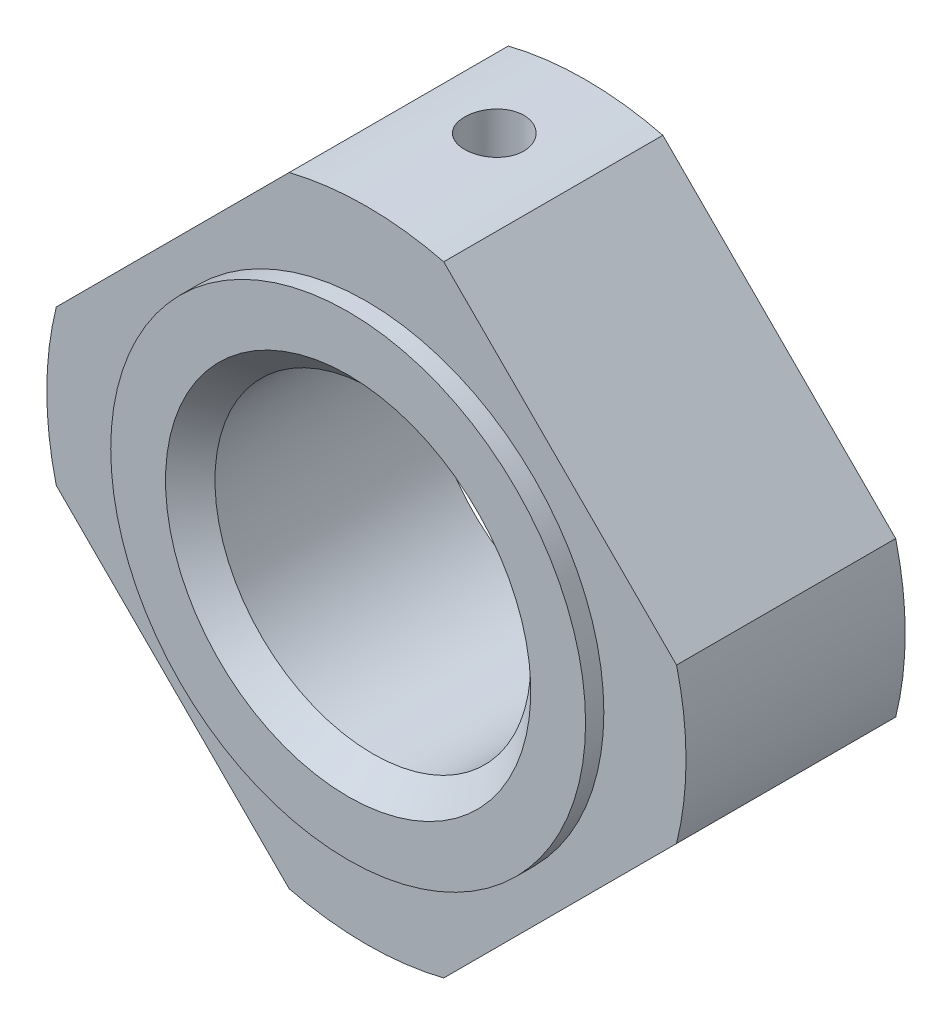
ISO-10303-21;
HEADER;
FILE_DESCRIPTION(('STEP AP214'),'2;1');
FILE_NAME('part.step','',(''),(''),'','','');
FILE_SCHEMA(('AUTOMOTIVE_DESIGN { 1 0 10303 214 1 1 1 1 }'));
ENDSEC;
DATA;
#1=APPLICATION_CONTEXT('core data for automotive mechanical design processes');
#2=APPLICATION_PROTOCOL_DEFINITION('international standard','automotive_design',2000,#1);
#3=PRODUCT_CONTEXT('',#1,'mechanical');
#4=PRODUCT('Part','Part','',(#3));
#5=PRODUCT_RELATED_PRODUCT_CATEGORY('part','',(#4));
#6=PRODUCT_DEFINITION_FORMATION('','',#4);
#7=PRODUCT_DEFINITION_CONTEXT('part definition',#1,'design');
#8=PRODUCT_DEFINITION('design','',#6,#7);
#9=PRODUCT_DEFINITION_SHAPE('','',#8);
#10=(LENGTH_UNIT() NAMED_UNIT(*) SI_UNIT(.MILLI.,.METRE.));
#11=(NAMED_UNIT(*) PLANE_ANGLE_UNIT() SI_UNIT($,.RADIAN.));
#12=(NAMED_UNIT(*) SI_UNIT($,.STERADIAN.) SOLID_ANGLE_UNIT());
#13=UNCERTAINTY_MEASURE_WITH_UNIT(LENGTH_MEASURE(1.E-05),#10,'distance_accuracy_value','');
#14=(GEOMETRIC_REPRESENTATION_CONTEXT(3) GLOBAL_UNCERTAINTY_ASSIGNED_CONTEXT((#13)) GLOBAL_UNIT_ASSIGNED_CONTEXT((#10,
#11,#12)) REPRESENTATION_CONTEXT('',''));
#15=CARTESIAN_POINT('',(0.,0.,0.));
#16=DIRECTION('',(0.,0.,1.));
#17=DIRECTION('',(1.,0.,0.));
#18=AXIS2_PLACEMENT_3D('',#15,#16,#17);
#19=CARTESIAN_POINT('',(-1.00613961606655E-13,0.,12.));
#20=DIRECTION('',(0.,0.,1.));
#21=DIRECTION('',(1.,0.,0.));
#22=AXIS2_PLACEMENT_3D('',#19,#20,#21);
#23=PLANE('',#22);
#24=CARTESIAN_POINT('',(0.,0.,12.));
#25=DIRECTION('',(0.,0.,1.));
#26=DIRECTION('',(1.,0.,0.));
#27=AXIS2_PLACEMENT_3D('',#24,#25,#26);
#28=CIRCLE('',#27,13.);
#29=CARTESIAN_POINT('',(13.,0.,12.));
#30=VERTEX_POINT('',#29);
#31=EDGE_CURVE('E19',#30,#30,#28,.T.);
#32=ORIENTED_EDGE('',*,*,#31,.F.);
#33=EDGE_LOOP('',(#32));
#34=FACE_BOUND('',#33,.T.);
#35=DIRECTION('',(0.707106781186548,-0.707106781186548,0.));
#36=VECTOR('',#35,1.);
#37=CARTESIAN_POINT('',(16.9803761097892,4.23282732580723,12.));
#38=LINE('',#37,#36);
#39=CARTESIAN_POINT('',(16.9803761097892,4.23282732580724,12.));
#40=VERTEX_POINT('',#39);
#41=CARTESIAN_POINT('',(4.23282732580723,16.9803761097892,12.));
#42=VERTEX_POINT('',#41);
#43=EDGE_CURVE('E105',#40,#42,#38,.F.);
#44=ORIENTED_EDGE('',*,*,#43,.T.);
#45=CARTESIAN_POINT('',(0.,0.,12.));
#46=DIRECTION('',(0.,0.,1.));
#47=DIRECTION('',(1.,0.,0.));
#48=AXIS2_PLACEMENT_3D('',#45,#46,#47);
#49=CIRCLE('',#48,17.5);
#50=CARTESIAN_POINT('',(-4.23282732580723,16.9803761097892,12.));
#51=VERTEX_POINT('',#50);
#52=EDGE_CURVE('E213',#51,#42,#49,.F.);
#53=ORIENTED_EDGE('',*,*,#52,.F.);
#54=DIRECTION('',(0.707106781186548,0.707106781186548,0.));
#55=VECTOR('',#54,1.);
#56=CARTESIAN_POINT('',(-4.23282732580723,16.9803761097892,12.));
#57=LINE('',#56,#55);
#58=CARTESIAN_POINT('',(-16.9803761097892,4.23282732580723,12.));
#59=VERTEX_POINT('',#58);
#60=EDGE_CURVE('E85',#51,#59,#57,.F.);
#61=ORIENTED_EDGE('',*,*,#60,.T.);
#62=CARTESIAN_POINT('',(-1.00613961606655E-13,0.,12.));
#63=DIRECTION('',(0.,0.,1.));
#64=DIRECTION('',(1.,0.,0.));
#65=AXIS2_PLACEMENT_3D('',#62,#63,#64);
#66=CIRCLE('',#65,17.5);
#67=CARTESIAN_POINT('',(-16.9803761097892,-4.23282732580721,12.));
#68=VERTEX_POINT('',#67);
#69=EDGE_CURVE('E79',#68,#59,#66,.F.);
#70=ORIENTED_EDGE('',*,*,#69,.F.);
#71=DIRECTION('',(-0.707106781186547,0.707106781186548,0.));
#72=VECTOR('',#71,1.);
#73=CARTESIAN_POINT('',(-16.9803761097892,-4.23282732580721,12.));
#74=LINE('',#73,#72);
#75=CARTESIAN_POINT('',(-4.23282732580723,-16.9803761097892,12.));
#76=VERTEX_POINT('',#75);
#77=EDGE_CURVE('E82',#68,#76,#74,.F.);
#78=ORIENTED_EDGE('',*,*,#77,.T.);
#79=CARTESIAN_POINT('',(0.,-1.17961196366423E-13,12.));
#80=DIRECTION('',(0.,0.,1.));
#81=DIRECTION('',(1.,0.,0.));
#82=AXIS2_PLACEMENT_3D('',#79,#80,#81);
#83=CIRCLE('',#82,17.5);
#84=CARTESIAN_POINT('',(4.23282732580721,-16.9803761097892,12.));
#85=VERTEX_POINT('',#84);
#86=EDGE_CURVE('E96',#85,#76,#83,.F.);
#87=ORIENTED_EDGE('',*,*,#86,.F.);
#88=DIRECTION('',(-0.707106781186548,-0.707106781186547,0.));
#89=VECTOR('',#88,1.);
#90=CARTESIAN_POINT('',(4.23282732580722,-16.9803761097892,12.));
#91=LINE('',#90,#89);
#92=CARTESIAN_POINT('',(16.9803761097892,-4.23282732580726,12.));
#93=VERTEX_POINT('',#92);
#94=EDGE_CURVE('E110',#85,#93,#91,.F.);
#95=ORIENTED_EDGE('',*,*,#94,.T.);
#96=CARTESIAN_POINT('',(0.,0.,12.));
#97=DIRECTION('',(0.,0.,1.));
#98=DIRECTION('',(1.,0.,0.));
#99=AXIS2_PLACEMENT_3D('',#96,#97,#98);
#100=CIRCLE('',#99,17.5);
#101=EDGE_CURVE('E112',#40,#93,#100,.F.);
#102=ORIENTED_EDGE('',*,*,#101,.F.);
#103=EDGE_LOOP('',(#44,#53,#61,#70,#78,#87,#95,#102));
#104=FACE_BOUND('',#103,.T.);
#105=ADVANCED_FACE('F16',(#34,#104),#23,.T.);
#106=CARTESIAN_POINT('',(0.,0.,13.));
#107=DIRECTION('',(0.,0.,1.));
#108=DIRECTION('',(1.,0.,0.));
#109=AXIS2_PLACEMENT_3D('',#106,#107,#108);
#110=CYLINDRICAL_SURFACE('',#109,13.);
#111=CARTESIAN_POINT('',(0.,0.,13.));
#112=DIRECTION('',(0.,0.,1.));
#113=DIRECTION('',(1.,0.,0.));
#114=AXIS2_PLACEMENT_3D('',#111,#112,#113);
#115=CIRCLE('',#114,13.);
#116=CARTESIAN_POINT('',(13.,0.,13.));
#117=VERTEX_POINT('',#116);
#118=EDGE_CURVE('E205',#117,#117,#115,.T.);
#119=ORIENTED_EDGE('',*,*,#118,.F.);
#120=EDGE_LOOP('',(#119));
#121=FACE_BOUND('',#120,.T.);
#122=ORIENTED_EDGE('',*,*,#31,.T.);
#123=EDGE_LOOP('',(#122));
#124=FACE_BOUND('',#123,.T.);
#125=ADVANCED_FACE('F194',(#121,#124),#110,.T.);
#126=CARTESIAN_POINT('',(-1.00613961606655E-13,0.,12.));
#127=DIRECTION('',(0.,0.,1.));
#128=DIRECTION('',(1.,0.,0.));
#129=AXIS2_PLACEMENT_3D('',#126,#127,#128);
#130=CYLINDRICAL_SURFACE('',#129,17.5);
#131=ORIENTED_EDGE('',*,*,#69,.T.);
#132=DIRECTION('',(0.,0.,1.));
#133=VECTOR('',#132,1.);
#134=CARTESIAN_POINT('',(-16.9803761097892,4.23282732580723,12.));
#135=LINE('',#134,#133);
#136=CARTESIAN_POINT('',(-16.9803761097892,4.23282732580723,0.));
#137=VERTEX_POINT('',#136);
#138=EDGE_CURVE('E109',#59,#137,#135,.F.);
#139=ORIENTED_EDGE('',*,*,#138,.T.);
#140=CARTESIAN_POINT('',(-1.00613961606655E-13,0.,0.));
#141=DIRECTION('',(0.,0.,1.));
#142=DIRECTION('',(1.,0.,0.));
#143=AXIS2_PLACEMENT_3D('',#140,#141,#142);
#144=CIRCLE('',#143,17.5);
#145=CARTESIAN_POINT('',(-16.9803761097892,-4.23282732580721,0.));
#146=VERTEX_POINT('',#145);
#147=EDGE_CURVE('E100',#137,#146,#144,.T.);
#148=ORIENTED_EDGE('',*,*,#147,.T.);
#149=DIRECTION('',(0.,0.,1.));
#150=VECTOR('',#149,1.);
#151=CARTESIAN_POINT('',(-16.9803761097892,-4.23282732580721,12.));
#152=LINE('',#151,#150);
#153=EDGE_CURVE('E90',#146,#68,#152,.T.);
#154=ORIENTED_EDGE('',*,*,#153,.T.);
#155=EDGE_LOOP('',(#131,#139,#148,#154));
#156=FACE_BOUND('',#155,.T.);
#157=ADVANCED_FACE('F99',(#156),#130,.T.);
#158=CARTESIAN_POINT('',(-16.9803761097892,-4.23282732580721,12.));
#159=DIRECTION('',(0.707106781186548,0.707106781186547,0.));
#160=DIRECTION('',(-0.707106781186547,0.707106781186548,0.));
#161=AXIS2_PLACEMENT_3D('',#158,#159,#160);
#162=PLANE('',#161);
#163=DIRECTION('',(0.,0.,1.));
#164=VECTOR('',#163,1.);
#165=CARTESIAN_POINT('',(-4.23282732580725,-16.9803761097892,12.));
#166=LINE('',#165,#164);
#167=CARTESIAN_POINT('',(-4.23282732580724,-16.9803761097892,0.));
#168=VERTEX_POINT('',#167);
#169=EDGE_CURVE('E95',#76,#168,#166,.F.);
#170=ORIENTED_EDGE('',*,*,#169,.F.);
#171=ORIENTED_EDGE('',*,*,#77,.F.);
#172=ORIENTED_EDGE('',*,*,#153,.F.);
#173=DIRECTION('',(0.707106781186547,-0.707106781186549,0.));
#174=VECTOR('',#173,1.);
#175=CARTESIAN_POINT('',(-16.9803761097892,-4.2328273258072,0.));
#176=LINE('',#175,#174);
#177=EDGE_CURVE('E211',#146,#168,#176,.T.);
#178=ORIENTED_EDGE('',*,*,#177,.T.);
#179=EDGE_LOOP('',(#170,#171,#172,#178));
#180=FACE_BOUND('',#179,.T.);
#181=ADVANCED_FACE('F92',(#180),#162,.F.);
#182=CARTESIAN_POINT('',(0.,-1.17961196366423E-13,12.));
#183=DIRECTION('',(0.,0.,1.));
#184=DIRECTION('',(1.,0.,0.));
#185=AXIS2_PLACEMENT_3D('',#182,#183,#184);
#186=CYLINDRICAL_SURFACE('',#185,17.5);
#187=ORIENTED_EDGE('',*,*,#86,.T.);
#188=ORIENTED_EDGE('',*,*,#169,.T.);
#189=CARTESIAN_POINT('',(0.,-1.17961196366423E-13,0.));
#190=DIRECTION('',(0.,0.,1.));
#191=DIRECTION('',(1.,0.,0.));
#192=AXIS2_PLACEMENT_3D('',#189,#190,#191);
#193=CIRCLE('',#192,17.5);
#194=CARTESIAN_POINT('',(4.2328273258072,-16.9803761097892,0.));
#195=VERTEX_POINT('',#194);
#196=EDGE_CURVE('E230',#168,#195,#193,.T.);
#197=ORIENTED_EDGE('',*,*,#196,.T.);
#198=DIRECTION('',(0.,0.,1.));
#199=VECTOR('',#198,1.);
#200=CARTESIAN_POINT('',(4.23282732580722,-16.9803761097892,12.));
#201=LINE('',#200,#199);
#202=EDGE_CURVE('E113',#195,#85,#201,.T.);
#203=ORIENTED_EDGE('',*,*,#202,.T.);
#204=EDGE_LOOP('',(#187,#188,#197,#203));
#205=FACE_BOUND('',#204,.T.);
#206=ADVANCED_FACE('F186',(#205),#186,.T.);
#207=CARTESIAN_POINT('',(4.23282732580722,-16.9803761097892,12.));
#208=DIRECTION('',(-0.707106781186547,0.707106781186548,0.));
#209=DIRECTION('',(-0.707106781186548,-0.707106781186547,0.));
#210=AXIS2_PLACEMENT_3D('',#207,#208,#209);
#211=PLANE('',#210);
#212=DIRECTION('',(0.,0.,1.));
#213=VECTOR('',#212,1.);
#214=CARTESIAN_POINT('',(16.9803761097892,-4.23282732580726,12.));
#215=LINE('',#214,#213);
#216=CARTESIAN_POINT('',(16.9803761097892,-4.23282732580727,0.));
#217=VERTEX_POINT('',#216);
#218=EDGE_CURVE('E219',#93,#217,#215,.F.);
#219=ORIENTED_EDGE('',*,*,#218,.F.);
#220=ORIENTED_EDGE('',*,*,#94,.F.);
#221=ORIENTED_EDGE('',*,*,#202,.F.);
#222=DIRECTION('',(0.707106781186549,0.707106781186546,0.));
#223=VECTOR('',#222,1.);
#224=CARTESIAN_POINT('',(4.23282732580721,-16.9803761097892,0.));
#225=LINE('',#224,#223);
#226=EDGE_CURVE('E231',#195,#217,#225,.T.);
#227=ORIENTED_EDGE('',*,*,#226,.T.);
#228=EDGE_LOOP('',(#219,#220,#221,#227));
#229=FACE_BOUND('',#228,.T.);
#230=ADVANCED_FACE('F182',(#229),#211,.F.);
#231=CARTESIAN_POINT('',(0.,0.,12.));
#232=DIRECTION('',(0.,0.,1.));
#233=DIRECTION('',(1.,0.,0.));
#234=AXIS2_PLACEMENT_3D('',#231,#232,#233);
#235=CYLINDRICAL_SURFACE('',#234,17.5);
#236=ORIENTED_EDGE('',*,*,#101,.T.);
#237=ORIENTED_EDGE('',*,*,#218,.T.);
#238=CARTESIAN_POINT('',(0.,0.,0.));
#239=DIRECTION('',(0.,0.,1.));
#240=DIRECTION('',(1.,0.,0.));
#241=AXIS2_PLACEMENT_3D('',#238,#239,#240);
#242=CIRCLE('',#241,17.5);
#243=CARTESIAN_POINT('',(16.9803761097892,4.23282732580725,0.));
#244=VERTEX_POINT('',#243);
#245=EDGE_CURVE('E234',#217,#244,#242,.T.);
#246=ORIENTED_EDGE('',*,*,#245,.T.);
#247=DIRECTION('',(0.,0.,1.));
#248=VECTOR('',#247,1.);
#249=CARTESIAN_POINT('',(16.9803761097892,4.23282732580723,12.));
#250=LINE('',#249,#248);
#251=EDGE_CURVE('E107',#244,#40,#250,.T.);
#252=ORIENTED_EDGE('',*,*,#251,.T.);
#253=EDGE_LOOP('',(#236,#237,#246,#252));
#254=FACE_BOUND('',#253,.T.);
#255=ADVANCED_FACE('F178',(#254),#235,.T.);
#256=CARTESIAN_POINT('',(16.9803761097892,4.23282732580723,12.));
#257=DIRECTION('',(-0.707106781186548,-0.707106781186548,0.));
#258=DIRECTION('',(0.707106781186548,-0.707106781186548,0.));
#259=AXIS2_PLACEMENT_3D('',#256,#257,#258);
#260=PLANE('',#259);
#261=DIRECTION('',(0.,0.,1.));
#262=VECTOR('',#261,1.);
#263=CARTESIAN_POINT('',(4.23282732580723,16.9803761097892,12.));
#264=LINE('',#263,#262);
#265=CARTESIAN_POINT('',(4.23282732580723,16.9803761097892,0.));
#266=VERTEX_POINT('',#265);
#267=EDGE_CURVE('E209',#42,#266,#264,.F.);
#268=ORIENTED_EDGE('',*,*,#267,.F.);
#269=ORIENTED_EDGE('',*,*,#43,.F.);
#270=ORIENTED_EDGE('',*,*,#251,.F.);
#271=DIRECTION('',(-0.707106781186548,0.707106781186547,0.));
#272=VECTOR('',#271,1.);
#273=CARTESIAN_POINT('',(16.9803761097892,4.23282732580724,0.));
#274=LINE('',#273,#272);
#275=EDGE_CURVE('E235',#244,#266,#274,.T.);
#276=ORIENTED_EDGE('',*,*,#275,.T.);
#277=EDGE_LOOP('',(#268,#269,#270,#276));
#278=FACE_BOUND('',#277,.T.);
#279=ADVANCED_FACE('F175',(#278),#260,.F.);
#280=CARTESIAN_POINT('',(-4.23282732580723,16.9803761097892,12.));
#281=DIRECTION('',(0.707106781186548,-0.707106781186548,0.));
#282=DIRECTION('',(0.707106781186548,0.707106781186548,0.));
#283=AXIS2_PLACEMENT_3D('',#280,#281,#282);
#284=PLANE('',#283);
#285=ORIENTED_EDGE('',*,*,#138,.F.);
#286=ORIENTED_EDGE('',*,*,#60,.F.);
#287=DIRECTION('',(0.,0.,1.));
#288=VECTOR('',#287,1.);
#289=CARTESIAN_POINT('',(-4.23282732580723,16.9803761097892,12.));
#290=LINE('',#289,#288);
#291=CARTESIAN_POINT('',(-4.23282732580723,16.9803761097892,0.));
#292=VERTEX_POINT('',#291);
#293=EDGE_CURVE('E34',#292,#51,#290,.T.);
#294=ORIENTED_EDGE('',*,*,#293,.F.);
#295=DIRECTION('',(-0.707106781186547,-0.707106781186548,0.));
#296=VECTOR('',#295,1.);
#297=CARTESIAN_POINT('',(-4.23282732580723,16.9803761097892,0.));
#298=LINE('',#297,#296);
#299=EDGE_CURVE('E156',#292,#137,#298,.T.);
#300=ORIENTED_EDGE('',*,*,#299,.T.);
#301=EDGE_LOOP('',(#285,#286,#294,#300));
#302=FACE_BOUND('',#301,.T.);
#303=ADVANCED_FACE('F171',(#302),#284,.F.);
#304=CARTESIAN_POINT('',(0.,0.,12.));
#305=DIRECTION('',(0.,0.,1.));
#306=DIRECTION('',(1.,0.,0.));
#307=AXIS2_PLACEMENT_3D('',#304,#305,#306);
#308=CYLINDRICAL_SURFACE('',#307,17.5);
#309=CARTESIAN_POINT('',(0.187161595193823,17.4989991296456,3.38984114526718));
#310=CARTESIAN_POINT('',(0.277498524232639,17.4980320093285,3.40034571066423));
#311=CARTESIAN_POINT('',(0.367003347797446,17.4963687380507,3.41847674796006));
#312=CARTESIAN_POINT('',(0.541747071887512,17.4918317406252,3.46949229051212));
#313=CARTESIAN_POINT('',(0.626981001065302,17.4889566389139,3.50239356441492));
#314=CARTESIAN_POINT('',(0.790655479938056,17.4823216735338,3.58198114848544));
#315=CARTESIAN_POINT('',(0.869100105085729,17.4785623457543,3.62865911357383));
#316=CARTESIAN_POINT('',(1.01702721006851,17.4705796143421,3.73447006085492));
#317=CARTESIAN_POINT('',(1.08651159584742,17.4663563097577,3.79360038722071));
#318=CARTESIAN_POINT('',(1.21477385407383,17.4579058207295,3.92283894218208));
#319=CARTESIAN_POINT('',(1.27352198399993,17.4536786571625,3.99297669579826));
#320=CARTESIAN_POINT('',(1.37841829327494,17.445708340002,4.14214347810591));
#321=CARTESIAN_POINT('',(1.424566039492,17.4419652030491,4.22117281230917));
#322=CARTESIAN_POINT('',(1.5029454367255,17.4353867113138,4.38590200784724));
#323=CARTESIAN_POINT('',(1.5351756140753,17.4325514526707,4.47160257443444));
#324=CARTESIAN_POINT('',(1.58477781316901,17.4281124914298,4.64723080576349));
#325=CARTESIAN_POINT('',(1.60215023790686,17.426508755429,4.73715835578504));
#326=CARTESIAN_POINT('',(1.62149297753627,17.4247196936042,4.91832962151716));
#327=CARTESIAN_POINT('',(1.62352037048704,17.4245291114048,5.00956719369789));
#328=CARTESIAN_POINT('',(1.61226443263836,17.4255741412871,5.19108351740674));
#329=CARTESIAN_POINT('',(1.59898130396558,17.4268097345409,5.28136228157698));
#330=CARTESIAN_POINT('',(1.55752868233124,17.4305631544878,5.45823810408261));
#331=CARTESIAN_POINT('',(1.52938527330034,17.4330787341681,5.54484132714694));
#332=CARTESIAN_POINT('',(1.45903717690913,17.4391069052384,5.71209751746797));
#333=CARTESIAN_POINT('',(1.41683219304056,17.4426195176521,5.79275035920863));
#334=CARTESIAN_POINT('',(1.31941333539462,17.4502588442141,5.94607812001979));
#335=CARTESIAN_POINT('',(1.26416134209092,17.4543873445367,6.01872872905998));
#336=CARTESIAN_POINT('',(1.14227261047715,17.4627871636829,6.15374443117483));
#337=CARTESIAN_POINT('',(1.07563564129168,17.4670584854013,6.21610931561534));
#338=CARTESIAN_POINT('',(0.932623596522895,17.4752782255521,6.32897593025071));
#339=CARTESIAN_POINT('',(0.856219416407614,17.4792256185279,6.37944086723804));
#340=CARTESIAN_POINT('',(0.695987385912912,17.4863382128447,6.46682300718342));
#341=CARTESIAN_POINT('',(0.612159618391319,17.4895034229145,6.50374036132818));
#342=CARTESIAN_POINT('',(0.439595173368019,17.4946903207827,6.56291512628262));
#343=CARTESIAN_POINT('',(0.350866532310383,17.4967138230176,6.58519580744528));
#344=CARTESIAN_POINT('',(0.170908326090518,17.4993966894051,6.61454090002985));
#345=CARTESIAN_POINT('',(0.0796788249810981,17.5000560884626,6.62160570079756));
#346=CARTESIAN_POINT('',(-0.102328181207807,17.4999365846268,6.62031519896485));
#347=CARTESIAN_POINT('',(-0.193106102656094,17.4991630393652,6.61201733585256));
#348=CARTESIAN_POINT('',(-0.371972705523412,17.4962750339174,6.58035637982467));
#349=CARTESIAN_POINT('',(-0.460061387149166,17.4941605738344,6.55699328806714));
#350=CARTESIAN_POINT('',(-0.63105359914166,17.4888276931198,6.49587947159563));
#351=CARTESIAN_POINT('',(-0.713957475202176,17.4856093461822,6.45812970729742));
#352=CARTESIAN_POINT('',(-0.872263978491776,17.4784279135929,6.36931887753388));
#353=CARTESIAN_POINT('',(-0.947666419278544,17.4744648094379,6.31825748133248));
#354=CARTESIAN_POINT('',(-1.08912857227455,17.4662201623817,6.20404905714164));
#355=CARTESIAN_POINT('',(-1.15515268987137,17.4619374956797,6.14085801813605));
#356=CARTESIAN_POINT('',(-1.27567162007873,17.4535475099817,6.00428933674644));
#357=CARTESIAN_POINT('',(-1.33016629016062,17.4494401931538,5.93091156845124));
#358=CARTESIAN_POINT('',(-1.42616860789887,17.4418569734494,5.77589303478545));
#359=CARTESIAN_POINT('',(-1.46765350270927,17.4383821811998,5.69423811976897));
#360=CARTESIAN_POINT('',(-1.53631360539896,17.4324678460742,5.52508366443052));
#361=CARTESIAN_POINT('',(-1.56348912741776,17.4300282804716,5.43758425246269));
#362=CARTESIAN_POINT('',(-1.60268191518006,17.4264684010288,5.25949895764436));
#363=CARTESIAN_POINT('',(-1.61474372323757,17.4253442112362,5.1689229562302));
#364=CARTESIAN_POINT('',(-1.62350334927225,17.4245303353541,4.98702542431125));
#365=CARTESIAN_POINT('',(-1.62020145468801,17.4248406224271,4.89570390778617));
#366=CARTESIAN_POINT('',(-1.59836484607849,17.4268570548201,4.71520093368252));
#367=CARTESIAN_POINT('',(-1.57987658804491,17.4285589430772,4.62601380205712));
#368=CARTESIAN_POINT('',(-1.52826280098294,17.4331603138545,4.45201356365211));
#369=CARTESIAN_POINT('',(-1.49513708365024,17.4360598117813,4.36720051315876));
#370=CARTESIAN_POINT('',(-1.41513058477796,17.4427352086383,4.20419663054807));
#371=CARTESIAN_POINT('',(-1.36822726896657,17.4465125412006,4.12601691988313));
#372=CARTESIAN_POINT('',(-1.26201565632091,17.4545164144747,3.97862397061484));
#373=CARTESIAN_POINT('',(-1.20270748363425,17.4587429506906,3.9094106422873));
#374=CARTESIAN_POINT('',(-1.07310995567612,17.4671880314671,3.78164607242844));
#375=CARTESIAN_POINT('',(-1.00278118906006,17.4714064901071,3.72313479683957));
#376=CARTESIAN_POINT('',(-0.853257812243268,17.4793462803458,3.6187299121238));
#377=CARTESIAN_POINT('',(-0.774061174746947,17.4830674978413,3.57283919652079));
#378=CARTESIAN_POINT('',(-0.609019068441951,17.4895945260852,3.4949853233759));
#379=CARTESIAN_POINT('',(-0.523170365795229,17.4923998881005,3.46302899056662));
#380=CARTESIAN_POINT('',(-0.347358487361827,17.4967724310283,3.41403272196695));
#381=CARTESIAN_POINT('',(-0.25740014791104,17.4983410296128,3.39697570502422));
#382=CARTESIAN_POINT('',(-0.107905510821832,17.499766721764,3.38151301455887));
#383=CARTESIAN_POINT('',(-0.0487968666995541,17.5000317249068,3.37865751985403));
#384=CARTESIAN_POINT('',(0.0693788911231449,17.4999622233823,3.37940781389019));
#385=CARTESIAN_POINT('',(0.128446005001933,17.4996277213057,3.38301357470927));
#386=CARTESIAN_POINT('',(0.187161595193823,17.4989991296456,3.38984114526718));
#387=B_SPLINE_CURVE_WITH_KNOTS('',3,(#309,#310,#311,#312,#313,#314,#315,#316,#317,#318,#319,
#320,#321,#322,#323,#324,#325,#326,#327,#328,#329,#330,#331,#332,#333,#334,#335,#336,#337,#338,
#339,#340,#341,#342,#343,#344,#345,#346,#347,#348,#349,#350,#351,#352,#353,#354,#355,#356,#357,
#358,#359,#360,#361,#362,#363,#364,#365,#366,#367,#368,#369,#370,#371,#372,#373,#374,#375,#376,
#377,#378,#379,#380,#381,#382,#383,#384,#385,#386),.UNSPECIFIED.,.T.,.F.,(4,2,2,2,2,2,2,2,2,2,2,
2,2,2,2,2,2,2,2,2,2,2,2,2,2,2,2,2,2,2,2,2,2,2,2,2,2,2,4),(0.,0.272636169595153,
0.545582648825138,0.81836413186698,1.09108749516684,1.3645552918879,1.63803248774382,
1.91153863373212,2.18503736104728,2.45751826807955,2.72999557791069,3.00199619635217,
3.27400255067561,3.54681368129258,3.81963034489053,4.09327977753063,4.36692615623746,
4.64013641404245,4.91333968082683,5.18552352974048,5.45770735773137,5.72987301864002,
6.00204544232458,6.27522474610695,6.54840742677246,6.82206524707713,7.09571705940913,
7.36856046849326,7.64139877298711,7.91340554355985,8.18541581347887,8.45787347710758,
8.73032841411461,9.00378091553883,9.2772960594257,9.55094501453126,9.82427983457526,
10.0014838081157,10.178687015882),.UNSPECIFIED.);
#388=CARTESIAN_POINT('',(0.187161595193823,17.4989991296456,3.38984114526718));
#389=VERTEX_POINT('',#388);
#390=EDGE_CURVE('E153',#389,#389,#387,.T.);
#391=ORIENTED_EDGE('',*,*,#390,.T.);
#392=EDGE_LOOP('',(#391));
#393=FACE_BOUND('',#392,.T.);
#394=ORIENTED_EDGE('',*,*,#52,.T.);
#395=ORIENTED_EDGE('',*,*,#267,.T.);
#396=CARTESIAN_POINT('',(0.,0.,0.));
#397=DIRECTION('',(0.,0.,1.));
#398=DIRECTION('',(1.,0.,0.));
#399=AXIS2_PLACEMENT_3D('',#396,#397,#398);
#400=CIRCLE('',#399,17.5);
#401=EDGE_CURVE('E163',#266,#292,#400,.T.);
#402=ORIENTED_EDGE('',*,*,#401,.T.);
#403=ORIENTED_EDGE('',*,*,#293,.T.);
#404=EDGE_LOOP('',(#394,#395,#402,#403));
#405=FACE_BOUND('',#404,.T.);
#406=ADVANCED_FACE('F165',(#393,#405),#308,.T.);
#407=CARTESIAN_POINT('',(0.,0.,13.));
#408=DIRECTION('',(0.,0.,1.));
#409=DIRECTION('',(1.,0.,0.));
#410=AXIS2_PLACEMENT_3D('',#407,#408,#409);
#411=PLANE('',#410);
#412=CARTESIAN_POINT('',(0.,0.,13.));
#413=DIRECTION('',(0.,0.,1.));
#414=DIRECTION('',(0.,-1.,0.));
#415=AXIS2_PLACEMENT_3D('',#412,#413,#414);
#416=CIRCLE('',#415,10.);
#417=CARTESIAN_POINT('',(0.,-10.,13.));
#418=VERTEX_POINT('',#417);
#419=EDGE_CURVE('E145',#418,#418,#416,.F.);
#420=ORIENTED_EDGE('',*,*,#419,.T.);
#421=EDGE_LOOP('',(#420));
#422=FACE_BOUND('',#421,.T.);
#423=ORIENTED_EDGE('',*,*,#118,.T.);
#424=EDGE_LOOP('',(#423));
#425=FACE_BOUND('',#424,.T.);
#426=ADVANCED_FACE('F170',(#422,#425),#411,.T.);
#427=CARTESIAN_POINT('',(-1.00613961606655E-13,0.,0.));
#428=DIRECTION('',(0.,0.,1.));
#429=DIRECTION('',(1.,0.,0.));
#430=AXIS2_PLACEMENT_3D('',#427,#428,#429);
#431=PLANE('',#430);
#432=CARTESIAN_POINT('',(0.,0.,0.));
#433=DIRECTION('',(0.,0.,1.));
#434=DIRECTION('',(1.,0.,0.));
#435=AXIS2_PLACEMENT_3D('',#432,#433,#434);
#436=CIRCLE('',#435,8.647);
#437=CARTESIAN_POINT('',(8.647,0.,0.));
#438=VERTEX_POINT('',#437);
#439=EDGE_CURVE('E122',#438,#438,#436,.T.);
#440=ORIENTED_EDGE('',*,*,#439,.T.);
#441=EDGE_LOOP('',(#440));
#442=FACE_BOUND('',#441,.T.);
#443=ORIENTED_EDGE('',*,*,#401,.F.);
#444=ORIENTED_EDGE('',*,*,#275,.F.);
#445=ORIENTED_EDGE('',*,*,#245,.F.);
#446=ORIENTED_EDGE('',*,*,#226,.F.);
#447=ORIENTED_EDGE('',*,*,#196,.F.);
#448=ORIENTED_EDGE('',*,*,#177,.F.);
#449=ORIENTED_EDGE('',*,*,#147,.F.);
#450=ORIENTED_EDGE('',*,*,#299,.F.);
#451=EDGE_LOOP('',(#443,#444,#445,#446,#447,#448,#449,#450));
#452=FACE_BOUND('',#451,.T.);
#453=ADVANCED_FACE('F140',(#442,#452),#431,.F.);
#454=CARTESIAN_POINT('',(0.,7.5,5.));
#455=DIRECTION('',(0.,1.,0.));
#456=DIRECTION('',(0.,0.,1.));
#457=AXIS2_PLACEMENT_3D('',#454,#455,#456);
#458=CYLINDRICAL_SURFACE('',#457,1.621);
#459=ORIENTED_EDGE('',*,*,#390,.F.);
#460=EDGE_LOOP('',(#459));
#461=FACE_BOUND('',#460,.T.);
#462=CARTESIAN_POINT('',(0.187449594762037,8.64496797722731,3.38987466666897));
#463=CARTESIAN_POINT('',(0.277457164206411,8.64301476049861,3.40035683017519));
#464=CARTESIAN_POINT('',(0.366600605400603,8.63966286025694,3.41840675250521));
#465=CARTESIAN_POINT('',(0.540561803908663,8.63052800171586,3.46909900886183));
#466=CARTESIAN_POINT('',(0.625375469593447,8.62474278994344,3.50175487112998));
#467=CARTESIAN_POINT('',(0.788179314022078,8.61139073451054,3.58063876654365));
#468=CARTESIAN_POINT('',(0.866176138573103,8.60382565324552,3.62685338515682));
#469=CARTESIAN_POINT('',(1.0133198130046,8.58774003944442,3.73154502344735));
#470=CARTESIAN_POINT('',(1.08246759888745,8.57921960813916,3.79002074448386));
#471=CARTESIAN_POINT('',(1.21077396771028,8.56206038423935,3.91834053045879));
#472=CARTESIAN_POINT('',(1.26981664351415,8.55342130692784,3.9883005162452));
#473=CARTESIAN_POINT('',(1.3753511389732,8.53708844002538,4.13722585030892));
#474=CARTESIAN_POINT('',(1.42184264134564,8.52939467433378,4.21619142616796));
#475=CARTESIAN_POINT('',(1.50095799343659,8.5158296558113,4.38102546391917));
#476=CARTESIAN_POINT('',(1.53356989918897,8.50995997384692,4.46689979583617));
#477=CARTESIAN_POINT('',(1.58385892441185,8.50074470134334,4.64304316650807));
#478=CARTESIAN_POINT('',(1.60153773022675,8.4973988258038,4.73331170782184));
#479=CARTESIAN_POINT('',(1.62124313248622,8.49366116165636,4.91419791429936));
#480=CARTESIAN_POINT('',(1.62350554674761,8.49322486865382,5.00478900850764));
#481=CARTESIAN_POINT('',(1.61293160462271,8.49523917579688,5.18504925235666));
#482=CARTESIAN_POINT('',(1.60009594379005,8.49768964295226,5.27471844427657));
#483=CARTESIAN_POINT('',(1.55988560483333,8.50516166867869,5.44990631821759));
#484=CARTESIAN_POINT('',(1.53262051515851,8.51016383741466,5.53545105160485));
#485=CARTESIAN_POINT('',(1.46443481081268,8.52216117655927,5.70076226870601));
#486=CARTESIAN_POINT('',(1.42351312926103,8.52915650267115,5.78052830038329));
#487=CARTESIAN_POINT('',(1.32859822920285,8.54445820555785,5.93307849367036));
#488=CARTESIAN_POINT('',(1.27445252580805,8.55277945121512,6.00576626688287));
#489=CARTESIAN_POINT('',(1.15484713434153,8.56974779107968,6.14110754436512));
#490=CARTESIAN_POINT('',(1.08938646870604,8.57839491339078,6.20376018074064));
#491=CARTESIAN_POINT('',(0.947997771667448,8.595174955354,6.31807065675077));
#492=CARTESIAN_POINT('',(0.871945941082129,8.60329983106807,6.36957672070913));
#493=CARTESIAN_POINT('',(0.712128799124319,8.61799928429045,6.45907511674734));
#494=CARTESIAN_POINT('',(0.628363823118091,8.62457392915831,6.4970680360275));
#495=CARTESIAN_POINT('',(0.456006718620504,8.63539643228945,6.55820688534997));
#496=CARTESIAN_POINT('',(0.36744689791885,8.63965814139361,6.58144134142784));
#497=CARTESIAN_POINT('',(0.18759726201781,8.64543260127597,6.61269234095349));
#498=CARTESIAN_POINT('',(0.0963077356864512,8.64694564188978,6.6207104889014));
#499=CARTESIAN_POINT('',(-0.0849296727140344,8.64705066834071,6.621269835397));
#500=CARTESIAN_POINT('',(-0.174876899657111,8.64568661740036,6.61404396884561));
#501=CARTESIAN_POINT('',(-0.352251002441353,8.6402779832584,6.58481523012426));
#502=CARTESIAN_POINT('',(-0.439677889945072,8.63623341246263,6.56281242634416));
#503=CARTESIAN_POINT('',(-0.609482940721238,8.62591296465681,6.50473147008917));
#504=CARTESIAN_POINT('',(-0.691865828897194,8.61963921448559,6.46866673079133));
#505=CARTESIAN_POINT('',(-0.849452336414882,8.60553928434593,6.38350828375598));
#506=CARTESIAN_POINT('',(-0.924655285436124,8.59771295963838,6.33441336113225));
#507=CARTESIAN_POINT('',(-1.06693178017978,8.58122816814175,6.22373961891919));
#508=CARTESIAN_POINT('',(-1.13386996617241,8.57255918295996,6.16198831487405));
#509=CARTESIAN_POINT('',(-1.25650072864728,8.5554460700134,6.02814682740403));
#510=CARTESIAN_POINT('',(-1.31219261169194,8.54700195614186,5.95605600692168));
#511=CARTESIAN_POINT('',(-1.41118862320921,8.53121899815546,5.8028525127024));
#512=CARTESIAN_POINT('',(-1.45438754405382,8.52388977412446,5.72167077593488));
#513=CARTESIAN_POINT('',(-1.52649622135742,8.5112729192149,5.55304330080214));
#514=CARTESIAN_POINT('',(-1.55540722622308,8.50598510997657,5.46559811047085));
#515=CARTESIAN_POINT('',(-1.59779710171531,8.49812434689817,5.28797175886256));
#516=CARTESIAN_POINT('',(-1.61144678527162,8.49552136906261,5.19783271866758));
#517=CARTESIAN_POINT('',(-1.62345998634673,8.4932341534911,5.01650854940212));
#518=CARTESIAN_POINT('',(-1.62182484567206,8.49354965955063,4.92532351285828));
#519=CARTESIAN_POINT('',(-1.60344971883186,8.4970371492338,4.74578529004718));
#520=CARTESIAN_POINT('',(-1.58691204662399,8.50017087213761,4.65741054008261));
#521=CARTESIAN_POINT('',(-1.53952572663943,8.50888033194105,4.48471368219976));
#522=CARTESIAN_POINT('',(-1.50867650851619,8.51445616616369,4.40039173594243));
#523=CARTESIAN_POINT('',(-1.43336491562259,8.52745769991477,4.23764037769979));
#524=CARTESIAN_POINT('',(-1.38882645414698,8.53489369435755,4.15924703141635));
#525=CARTESIAN_POINT('',(-1.28745362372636,8.55077167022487,4.01097458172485));
#526=CARTESIAN_POINT('',(-1.23061830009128,8.5592137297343,3.94109614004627));
#527=CARTESIAN_POINT('',(-1.10520163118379,8.57631608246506,3.81067984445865));
#528=CARTESIAN_POINT('',(-1.03644954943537,8.58497771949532,3.75030624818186));
#529=CARTESIAN_POINT('',(-0.889696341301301,8.60142382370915,3.64191193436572));
#530=CARTESIAN_POINT('',(-0.811693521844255,8.60920812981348,3.59389348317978));
#531=CARTESIAN_POINT('',(-0.648438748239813,8.62304215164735,3.51152920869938));
#532=CARTESIAN_POINT('',(-0.563172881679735,8.62908843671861,3.47721037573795));
#533=CARTESIAN_POINT('',(-0.38799656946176,8.63873460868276,3.42346055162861));
#534=CARTESIAN_POINT('',(-0.298090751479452,8.64233688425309,3.40401502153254));
#535=CARTESIAN_POINT('',(-0.141801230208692,8.64608596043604,3.38386539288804));
#536=CARTESIAN_POINT('',(-0.0758898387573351,8.64691840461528,3.37943533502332));
#537=CARTESIAN_POINT('',(0.0559834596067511,8.64707013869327,3.37862577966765));
#538=CARTESIAN_POINT('',(0.121945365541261,8.64638945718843,3.38224613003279));
#539=CARTESIAN_POINT('',(0.187449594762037,8.64496797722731,3.38987466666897));
#540=B_SPLINE_CURVE_WITH_KNOTS('',3,(#462,#463,#464,#465,#466,#467,#468,#469,#470,#471,#472,
#473,#474,#475,#476,#477,#478,#479,#480,#481,#482,#483,#484,#485,#486,#487,#488,#489,#490,#491,
#492,#493,#494,#495,#496,#497,#498,#499,#500,#501,#502,#503,#504,#505,#506,#507,#508,#509,#510,
#511,#512,#513,#514,#515,#516,#517,#518,#519,#520,#521,#522,#523,#524,#525,#526,#527,#528,#529,
#530,#531,#532,#533,#534,#535,#536,#537,#538,#539),.UNSPECIFIED.,.T.,.F.,(4,2,2,2,2,2,2,2,2,2,2,
2,2,2,2,2,2,2,2,2,2,2,2,2,2,2,2,2,2,2,2,2,2,2,2,2,2,2,4),(0.,0.27166814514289,0.543588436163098,
0.815240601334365,1.08686400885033,1.36141996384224,1.63598285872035,1.91078155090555,
2.18554920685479,2.45610423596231,2.72664680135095,2.99516353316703,3.26370124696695,
3.53549517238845,3.80731259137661,4.0826260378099,4.35792751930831,4.63156165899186,
4.90516694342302,5.17462172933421,5.4440752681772,5.71327241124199,5.9824946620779,
6.25566424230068,6.52885066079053,6.8042748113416,7.07967489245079,7.35196068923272,
7.62422258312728,7.89284307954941,8.16147428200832,8.43162643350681,8.7017995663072,
8.97622345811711,9.2506976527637,9.52570996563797,9.80045310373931,9.99816701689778,
10.1958771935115),.UNSPECIFIED.);
#541=CARTESIAN_POINT('',(0.187449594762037,8.64496797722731,3.38987466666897));
#542=VERTEX_POINT('',#541);
#543=EDGE_CURVE('E25',#542,#542,#540,.T.);
#544=ORIENTED_EDGE('',*,*,#543,.T.);
#545=EDGE_LOOP('',(#544));
#546=FACE_BOUND('',#545,.T.);
#547=ADVANCED_FACE('F124',(#461,#546),#458,.F.);
#548=CARTESIAN_POINT('',(0.,0.,13.));
#549=DIRECTION('',(0.,0.,1.));
#550=DIRECTION('',(0.,-1.,0.));
#551=AXIS2_PLACEMENT_3D('',#548,#549,#550);
#552=CONICAL_SURFACE('',#551,10.,0.785398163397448);
#553=ORIENTED_EDGE('',*,*,#419,.F.);
#554=EDGE_LOOP('',(#553));
#555=FACE_BOUND('',#554,.T.);
#556=CARTESIAN_POINT('',(0.,0.,11.647));
#557=DIRECTION('',(0.,0.,1.));
#558=DIRECTION('',(1.,0.,0.));
#559=AXIS2_PLACEMENT_3D('',#556,#557,#558);
#560=CIRCLE('',#559,8.647);
#561=CARTESIAN_POINT('',(8.647,0.,11.647));
#562=VERTEX_POINT('',#561);
#563=EDGE_CURVE('E11',#562,#562,#560,.F.);
#564=ORIENTED_EDGE('',*,*,#563,.T.);
#565=EDGE_LOOP('',(#564));
#566=FACE_BOUND('',#565,.T.);
#567=ADVANCED_FACE('F131',(#555,#566),#552,.F.);
#568=CARTESIAN_POINT('',(0.,0.,0.));
#569=DIRECTION('',(0.,0.,1.));
#570=DIRECTION('',(1.,0.,0.));
#571=AXIS2_PLACEMENT_3D('',#568,#569,#570);
#572=CYLINDRICAL_SURFACE('',#571,8.647);
#573=ORIENTED_EDGE('',*,*,#563,.F.);
#574=EDGE_LOOP('',(#573));
#575=FACE_BOUND('',#574,.T.);
#576=ORIENTED_EDGE('',*,*,#543,.F.);
#577=EDGE_LOOP('',(#576));
#578=FACE_BOUND('',#577,.T.);
#579=ORIENTED_EDGE('',*,*,#439,.F.);
#580=EDGE_LOOP('',(#579));
#581=FACE_BOUND('',#580,.T.);
#582=ADVANCED_FACE('F128',(#575,#578,#581),#572,.F.);
#583=CLOSED_SHELL('',(#105,#125,#157,#181,#206,#230,#255,#279,#303,#406,#426,#453,#547,#567,#582));
#584=MANIFOLD_SOLID_BREP('B1',#583);
#585=ADVANCED_BREP_SHAPE_REPRESENTATION('',(#18,#584),#14);
#586=SHAPE_DEFINITION_REPRESENTATION(#9,#585);
ENDSEC;
END-ISO-10303-21;
